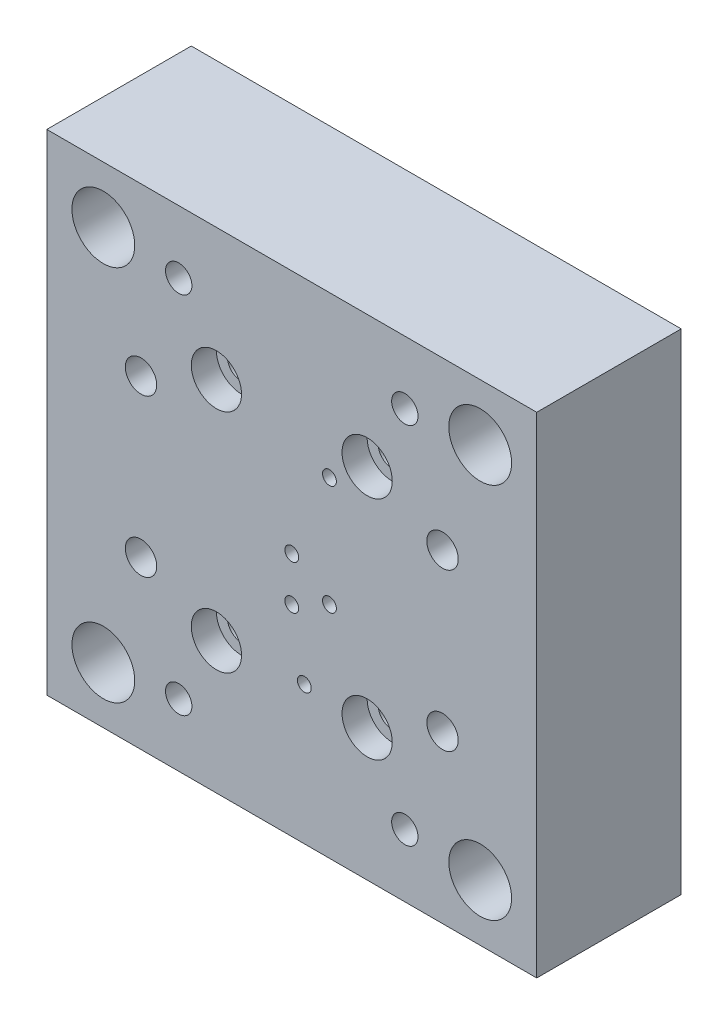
from build123d import *

# Parameters (mm, degrees)
ESQUISSE1_W                                        = 78
ESQUISSE1_H                                        = 78
EXTRUSION1_DEPTH                                   = 23
ESQUISSE2_R                                        = 5
ENL_V_MAT_EXTRU_1_DEPTH                            = 60.757844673
TROU_TARAUD_M5X0_81_D                              = 4.2
TROU_TARAUD_M5X0_81_DEPTH                          = 14
TROU_TARAUD_M5X0_81_TIP                            = 1.2618073
ESQUISSE5_R                                        = 2.5
ENL_V_MAT_EXTRU_2_DEPTH                            = 60.757844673
ENL_V_MAT_EXTRU_3_DEPTH                            = 12
CHAMBRAGE_POUR_VIS_T_TE_HEXAGONALE_M41_D           = 4.5
CHAMBRAGE_POUR_VIS_T_TE_HEXAGONALE_M41_CBORE_D     = 8
CHAMBRAGE_POUR_VIS_T_TE_HEXAGONALE_M41_CBORE_DEPTH = 4
ESQUISSE9_R                                        = 1.1
ENL_V_MAT_EXTRU_4_DEPTH                            = 57.444663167


with BuildPart() as part:
    # Esquisse1 → Extrusion1 (new body)
    with BuildSketch(Plane.XY):
        Rectangle(ESQUISSE1_W, ESQUISSE1_H)
    extrude(amount=EXTRUSION1_DEPTH)

    # Esquisse2 → Enl_v. mat.-Extru.1 (cut, through all)
    with BuildSketch(Plane.XY.offset(23)):
        with Locations((-30, 30)):
            Circle(ESQUISSE2_R)
        with Locations((30, 30)):
            Circle(ESQUISSE2_R)
        with Locations((30, -30)):
            Circle(ESQUISSE2_R)
        with Locations((-30, -30)):
            Circle(ESQUISSE2_R)
    extrude(amount=-ENL_V_MAT_EXTRU_1_DEPTH, mode=Mode.SUBTRACT)

    # Trou taraud_ M5x0.81
    with Locations(Plane.XY.offset(23)):
        with Locations((18, 29), (-18, 29), (-18, -29), (18, -29)):
            Hole(TROU_TARAUD_M5X0_81_D / 2, depth=TROU_TARAUD_M5X0_81_DEPTH)
            with Locations((0, 0, -(TROU_TARAUD_M5X0_81_DEPTH + TROU_TARAUD_M5X0_81_TIP / 2))):  # 118° drill point
                Cone(0, TROU_TARAUD_M5X0_81_D / 2, TROU_TARAUD_M5X0_81_TIP, mode=Mode.SUBTRACT)

    # Esquisse5 → Enl_v. mat.-Extru.2 (cut, through all)
    with BuildSketch(Plane.XY.offset(23)):
        with Locations((24, 12.5)):
            Circle(ESQUISSE5_R)
        with Locations((24, -12.5)):
            Circle(ESQUISSE5_R)
        with Locations((-24, -12.5)):
            Circle(ESQUISSE5_R)
        with Locations((-24, 12.5)):
            Circle(ESQUISSE5_R)
    extrude(amount=-ENL_V_MAT_EXTRU_2_DEPTH, mode=Mode.SUBTRACT)

    # Esquisse6 → Enl_v. mat.-Extru.3 (cut)
    with BuildSketch(Plane.XY):
        with BuildLine():
            Line((-12, 24), (12, 24))
            ThreePointArc((12, 24), (16.242640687, 22.242640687), (18, 18))
            Line((18, 18), (18, -18))
            ThreePointArc((18, -18), (16.242640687, -22.242640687), (12, -24))
            Line((12, -24), (-12, -24))
            ThreePointArc((-12, -24), (-16.242640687, -22.242640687), (-18, -18))
            Line((-18, -18), (-18, 18))
            ThreePointArc((-18, 18), (-16.242640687, 22.242640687), (-12, 24))
        make_face()
    extrude(amount=ENL_V_MAT_EXTRU_3_DEPTH, mode=Mode.SUBTRACT)

    # Chambrage pour vis _ t_te hexagonale M41 (through all)
    with Locations(Plane.XY.offset(23)):
        with Locations((12, 18), (-12, 18), (-12, -18), (12, -18)):
            CounterBoreHole(CHAMBRAGE_POUR_VIS_T_TE_HEXAGONALE_M41_D / 2, CHAMBRAGE_POUR_VIS_T_TE_HEXAGONALE_M41_CBORE_D / 2, CHAMBRAGE_POUR_VIS_T_TE_HEXAGONALE_M41_CBORE_DEPTH)

    # Esquisse9 → Enl_v. mat.-Extru.4 (cut, through all)
    with BuildSketch(Plane(origin=(0, 0, 12), x_dir=(-1, 0, 0), z_dir=(0, 0, -1))):
        Circle(ESQUISSE9_R)
        with Locations((0, -7)):
            Circle(ESQUISSE9_R)
        with Locations((-2, -17)):
            Circle(ESQUISSE9_R)
        with Locations((-6, -4)):
            Circle(ESQUISSE9_R)
        with Locations((-6, 13.5)):
            Circle(ESQUISSE9_R)
    extrude(amount=-ENL_V_MAT_EXTRU_4_DEPTH, mode=Mode.SUBTRACT)


solid = part.part
